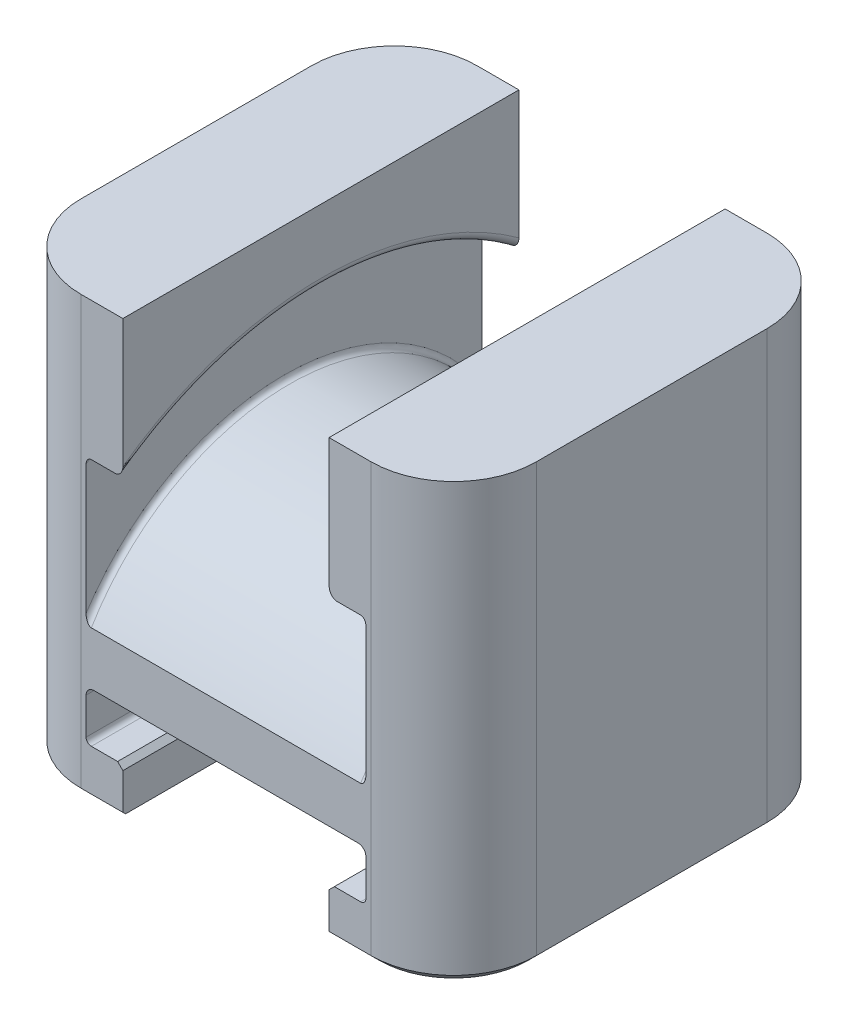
from build123d import *

# Parameters (mm, degrees)
SKETCH1_W               = 38.1
SKETCH1_H               = 41.91
EXTRUDE1_DEPTH          = 21.9075
CUT_REVOLVE1_ANGLE      = 180
CUT_EXTRUDE1_DEPTH      = 49.407037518
CUT_EXTRUDE1_DEPTH_BACK = 49.407037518
FILLET1_R               = 7.9502
FILLET2_R               = 0.508
FILLET3_R               = 0.508
FILLET4_R               = 0.762
CHAMFER1_SIZE           = 0.508
CHAMFER2_SIZE           = 0.508
CHAMFER3_SIZE           = 0.762


with BuildPart() as part:
    # Sketch1 → Extrude1 (new, symmetric)
    with BuildSketch(Plane(origin=(0, 0, 0), x_dir=(0, 0, -1), z_dir=(1, 0, 0))):
        with Locations((0, 17.78)):
            Rectangle(SKETCH1_W, SKETCH1_H)
    extrude(amount=EXTRUDE1_DEPTH, both=True)

    # Sketch2 → Cut-Revolve1 (revolve, symmetric, cut)
    with BuildSketch(Plane(origin=(0, 0, 0), x_dir=(-1, 0, 0), z_dir=(0, 0, -1))) as cut_revolve1_sk:
        Polygon((13.462, 22.225), (13.462, 31.8008), (9.9187, 31.8008), (9.9187, 43.2308), (-9.9187, 43.2308), (-9.9187, 31.8008), (-13.462, 31.8008), (-13.462, 22.225), align=None)
    revolve(axis=Axis((-18.438299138, 0, 0), (1, 0, 0)), revolution_arc=CUT_REVOLVE1_ANGLE / 2, mode=Mode.SUBTRACT)
    revolve(cut_revolve1_sk.sketch, axis=Axis((-18.438299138, 0, 0), (-1, 0, 0)), revolution_arc=CUT_REVOLVE1_ANGLE / 2, mode=Mode.SUBTRACT)

    # Sketch3 → Cut-Extrude1 (cut, two sides: drawn at the far end of the back side and taken through both)
    with BuildSketch(Plane.XY.offset(-CUT_EXTRUDE1_DEPTH_BACK)):
        Polygon((-13.462, 6.35), (13.462, 6.35), (13.462, 1.5748), (9.9187, 1.5748), (9.9187, -3.175), (-9.9187, -3.175), (-9.9187, 1.5748), (-13.462, 1.5748), align=None)
    extrude(amount=CUT_EXTRUDE1_DEPTH + CUT_EXTRUDE1_DEPTH_BACK, mode=Mode.SUBTRACT)

    # Fillet1
    fillet1_edges = [part.edges().sort_by_distance(p)[0] for p in [
        (21.9075, 17.78, -19.05),
        (21.9075, 17.78, 19.05),
        (-21.9075, 17.78, -19.05),
        (-21.9075, 17.78, 19.05),
    ]]
    fillet(fillet1_edges, radius=FILLET1_R)

    # Fillet2
    fillet2_edges = [part.edges().sort_by_distance(p)[0] for p in [
        (-13.462, 1.5748, 0),
        (13.462, 1.5748, 0),
    ]]
    fillet(fillet2_edges, radius=FILLET2_R)

    # Fillet3
    fillet3_edges = [part.edges().sort_by_distance(p)[0] for p in [
        (-13.462, 22.225, 0),
        (-13.462, 31.8008, 0),
        (13.462, 31.8008, 0),
        (13.462, 22.225, 0),
    ]]
    fillet(fillet3_edges, radius=FILLET3_R)

    # Fillet4
    fillet4_edges = [part.edges().sort_by_distance(p)[0] for p in [
        (-9.9187, 31.8008, 0),
        (9.9187, 31.8008, 0),
        (-13.462, 6.35, 0),
        (13.462, 6.35, 0),
    ]]
    fillet(fillet4_edges, radius=FILLET4_R)

    # Chamfer1
    chamfer1_edges = [part.edges().sort_by_distance(p)[0] for p in [
        (9.9187, 1.5748, 0),
        (-9.9187, 1.5748, 0),
    ]]
    chamfer(chamfer1_edges, length=CHAMFER1_SIZE)

    # Chamfer2
    chamfer2_edges = [part.edges().sort_by_distance(p)[0] for p in [
        (9.9187, -3.175, 0),
        (-9.9187, -3.175, 0),
    ]]
    chamfer(chamfer2_edges, length=CHAMFER2_SIZE)

    # Chamfer3
    chamfer3_edges = [part.edges().sort_by_distance(p)[0] for p in [
        (-19.578940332, -3.175, 16.721440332),
        (-12.192, -3.175, 19.05),
        (12.192, -3.175, 19.05),
        (-21.9075, -3.175, 0),
        (-12.192, -3.175, -19.05),
        (12.192, -3.175, -19.05),
        (-19.578940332, -3.175, -16.721440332),
        (19.578940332, -3.175, 16.721440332),
        (21.9075, -3.175, 0),
        (19.578940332, -3.175, -16.721440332),
    ]]
    chamfer(chamfer3_edges, length=CHAMFER3_SIZE)


solid = part.part
